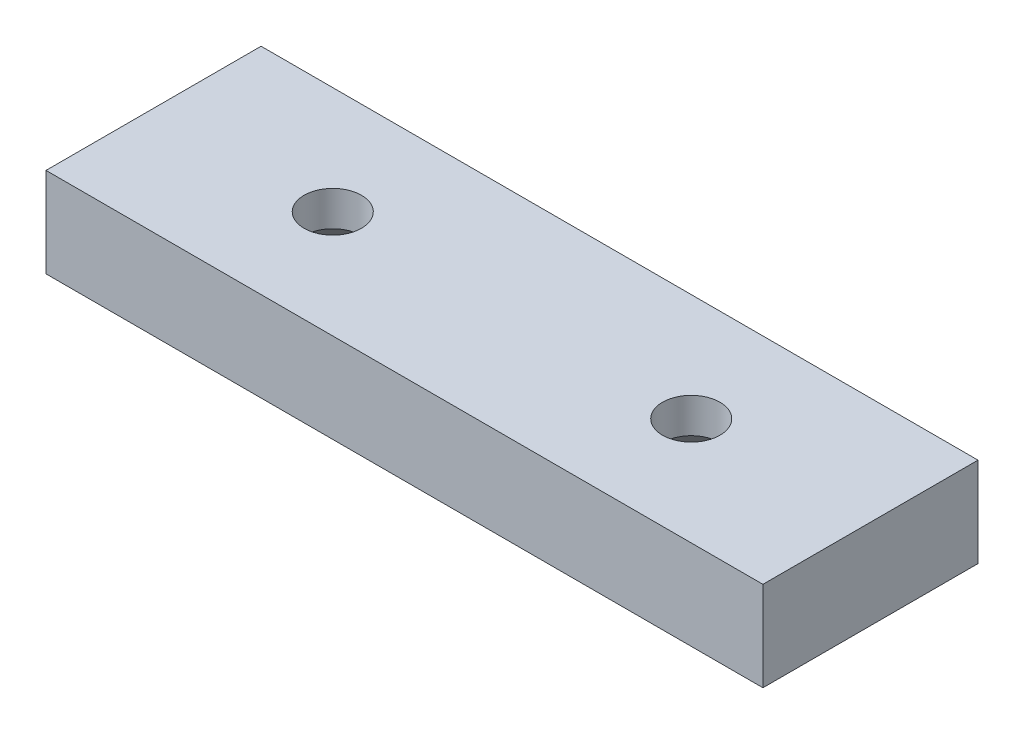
ISO-10303-21;
HEADER;
FILE_DESCRIPTION(('STEP AP214'),'2;1');
FILE_NAME('part.step','',(''),(''),'','','');
FILE_SCHEMA(('AUTOMOTIVE_DESIGN { 1 0 10303 214 1 1 1 1 }'));
ENDSEC;
DATA;
#1=APPLICATION_CONTEXT('core data for automotive mechanical design processes');
#2=APPLICATION_PROTOCOL_DEFINITION('international standard','automotive_design',2000,#1);
#3=PRODUCT_CONTEXT('',#1,'mechanical');
#4=PRODUCT('Part','Part','',(#3));
#5=PRODUCT_RELATED_PRODUCT_CATEGORY('part','',(#4));
#6=PRODUCT_DEFINITION_FORMATION('','',#4);
#7=PRODUCT_DEFINITION_CONTEXT('part definition',#1,'design');
#8=PRODUCT_DEFINITION('design','',#6,#7);
#9=PRODUCT_DEFINITION_SHAPE('','',#8);
#10=(LENGTH_UNIT() NAMED_UNIT(*) SI_UNIT(.MILLI.,.METRE.));
#11=(NAMED_UNIT(*) PLANE_ANGLE_UNIT() SI_UNIT($,.RADIAN.));
#12=(NAMED_UNIT(*) SI_UNIT($,.STERADIAN.) SOLID_ANGLE_UNIT());
#13=UNCERTAINTY_MEASURE_WITH_UNIT(LENGTH_MEASURE(1.E-05),#10,'distance_accuracy_value','');
#14=(GEOMETRIC_REPRESENTATION_CONTEXT(3) GLOBAL_UNCERTAINTY_ASSIGNED_CONTEXT((#13)) GLOBAL_UNIT_ASSIGNED_CONTEXT((#10,
#11,#12)) REPRESENTATION_CONTEXT('',''));
#15=CARTESIAN_POINT('',(0.,0.,0.));
#16=DIRECTION('',(0.,0.,1.));
#17=DIRECTION('',(1.,0.,0.));
#18=AXIS2_PLACEMENT_3D('',#15,#16,#17);
#19=CARTESIAN_POINT('',(0.,10.,12.));
#20=DIRECTION('',(1.,0.,0.));
#21=DIRECTION('',(0.,0.,-1.));
#22=AXIS2_PLACEMENT_3D('',#19,#20,#21);
#23=PLANE('',#22);
#24=DIRECTION('',(0.,0.,1.));
#25=VECTOR('',#24,1.);
#26=CARTESIAN_POINT('',(0.,0.,12.));
#27=LINE('',#26,#25);
#28=CARTESIAN_POINT('',(0.,0.,-12.));
#29=VERTEX_POINT('',#28);
#30=CARTESIAN_POINT('',(0.,0.,12.));
#31=VERTEX_POINT('',#30);
#32=EDGE_CURVE('E80',#29,#31,#27,.T.);
#33=ORIENTED_EDGE('',*,*,#32,.T.);
#34=DIRECTION('',(0.,-1.,0.));
#35=VECTOR('',#34,1.);
#36=CARTESIAN_POINT('',(0.,10.,12.));
#37=LINE('',#36,#35);
#38=CARTESIAN_POINT('',(0.,10.,12.));
#39=VERTEX_POINT('',#38);
#40=EDGE_CURVE('E11',#39,#31,#37,.T.);
#41=ORIENTED_EDGE('',*,*,#40,.F.);
#42=DIRECTION('',(0.,0.,1.));
#43=VECTOR('',#42,1.);
#44=CARTESIAN_POINT('',(0.,10.,12.));
#45=LINE('',#44,#43);
#46=CARTESIAN_POINT('',(0.,9.99999999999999,-12.));
#47=VERTEX_POINT('',#46);
#48=EDGE_CURVE('E103',#47,#39,#45,.T.);
#49=ORIENTED_EDGE('',*,*,#48,.F.);
#50=DIRECTION('',(0.,-1.,0.));
#51=VECTOR('',#50,1.);
#52=CARTESIAN_POINT('',(0.,9.99999999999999,-12.));
#53=LINE('',#52,#51);
#54=EDGE_CURVE('E92',#47,#29,#53,.T.);
#55=ORIENTED_EDGE('',*,*,#54,.T.);
#56=EDGE_LOOP('',(#33,#41,#49,#55));
#57=FACE_BOUND('',#56,.T.);
#58=ADVANCED_FACE('F36',(#57),#23,.F.);
#59=CARTESIAN_POINT('',(0.,10.,12.));
#60=DIRECTION('',(0.,0.,-1.));
#61=DIRECTION('',(-1.,0.,0.));
#62=AXIS2_PLACEMENT_3D('',#59,#60,#61);
#63=PLANE('',#62);
#64=DIRECTION('',(1.,0.,0.));
#65=VECTOR('',#64,1.);
#66=CARTESIAN_POINT('',(0.,0.,12.));
#67=LINE('',#66,#65);
#68=CARTESIAN_POINT('',(80.,0.,12.));
#69=VERTEX_POINT('',#68);
#70=EDGE_CURVE('E76',#31,#69,#67,.T.);
#71=ORIENTED_EDGE('',*,*,#70,.T.);
#72=DIRECTION('',(0.,-1.,0.));
#73=VECTOR('',#72,1.);
#74=CARTESIAN_POINT('',(80.,9.99999999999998,12.));
#75=LINE('',#74,#73);
#76=CARTESIAN_POINT('',(80.,9.99999999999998,12.));
#77=VERTEX_POINT('',#76);
#78=EDGE_CURVE('E43',#77,#69,#75,.T.);
#79=ORIENTED_EDGE('',*,*,#78,.F.);
#80=DIRECTION('',(1.,0.,0.));
#81=VECTOR('',#80,1.);
#82=CARTESIAN_POINT('',(0.,10.,12.));
#83=LINE('',#82,#81);
#84=EDGE_CURVE('E88',#39,#77,#83,.T.);
#85=ORIENTED_EDGE('',*,*,#84,.F.);
#86=ORIENTED_EDGE('',*,*,#40,.T.);
#87=EDGE_LOOP('',(#71,#79,#85,#86));
#88=FACE_BOUND('',#87,.T.);
#89=ADVANCED_FACE('F87',(#88),#63,.F.);
#90=CARTESIAN_POINT('',(80.,9.99999999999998,12.));
#91=DIRECTION('',(-1.,0.,0.));
#92=DIRECTION('',(0.,0.,1.));
#93=AXIS2_PLACEMENT_3D('',#90,#91,#92);
#94=PLANE('',#93);
#95=DIRECTION('',(0.,0.,-1.));
#96=VECTOR('',#95,1.);
#97=CARTESIAN_POINT('',(80.,0.,12.));
#98=LINE('',#97,#96);
#99=CARTESIAN_POINT('',(80.,0.,-12.));
#100=VERTEX_POINT('',#99);
#101=EDGE_CURVE('E81',#69,#100,#98,.T.);
#102=ORIENTED_EDGE('',*,*,#101,.T.);
#103=DIRECTION('',(0.,-1.,0.));
#104=VECTOR('',#103,1.);
#105=CARTESIAN_POINT('',(80.,9.99999999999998,-12.));
#106=LINE('',#105,#104);
#107=CARTESIAN_POINT('',(80.,9.99999999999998,-12.));
#108=VERTEX_POINT('',#107);
#109=EDGE_CURVE('E109',#108,#100,#106,.T.);
#110=ORIENTED_EDGE('',*,*,#109,.F.);
#111=DIRECTION('',(0.,0.,-1.));
#112=VECTOR('',#111,1.);
#113=CARTESIAN_POINT('',(80.,9.99999999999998,12.));
#114=LINE('',#113,#112);
#115=EDGE_CURVE('E55',#77,#108,#114,.T.);
#116=ORIENTED_EDGE('',*,*,#115,.F.);
#117=ORIENTED_EDGE('',*,*,#78,.T.);
#118=EDGE_LOOP('',(#102,#110,#116,#117));
#119=FACE_BOUND('',#118,.T.);
#120=ADVANCED_FACE('F112',(#119),#94,.F.);
#121=CARTESIAN_POINT('',(0.,9.99999999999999,-12.));
#122=DIRECTION('',(0.,0.,1.));
#123=DIRECTION('',(1.,0.,0.));
#124=AXIS2_PLACEMENT_3D('',#121,#122,#123);
#125=PLANE('',#124);
#126=DIRECTION('',(-1.,0.,0.));
#127=VECTOR('',#126,1.);
#128=CARTESIAN_POINT('',(0.,0.,-12.));
#129=LINE('',#128,#127);
#130=EDGE_CURVE('E101',#100,#29,#129,.T.);
#131=ORIENTED_EDGE('',*,*,#130,.T.);
#132=ORIENTED_EDGE('',*,*,#54,.F.);
#133=DIRECTION('',(-1.,0.,0.));
#134=VECTOR('',#133,1.);
#135=CARTESIAN_POINT('',(0.,9.99999999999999,-12.));
#136=LINE('',#135,#134);
#137=EDGE_CURVE('E50',#108,#47,#136,.T.);
#138=ORIENTED_EDGE('',*,*,#137,.F.);
#139=ORIENTED_EDGE('',*,*,#109,.T.);
#140=EDGE_LOOP('',(#131,#132,#138,#139));
#141=FACE_BOUND('',#140,.T.);
#142=ADVANCED_FACE('F114',(#141),#125,.F.);
#143=CARTESIAN_POINT('',(0.,9.99999999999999,-12.));
#144=DIRECTION('',(0.,-1.,0.));
#145=DIRECTION('',(0.,0.,-1.));
#146=AXIS2_PLACEMENT_3D('',#143,#144,#145);
#147=PLANE('',#146);
#148=CARTESIAN_POINT('',(20.,9.99999999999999,0.));
#149=DIRECTION('',(0.,-1.,0.));
#150=DIRECTION('',(0.,0.,-1.));
#151=AXIS2_PLACEMENT_3D('',#148,#149,#150);
#152=CIRCLE('',#151,3.19999999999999);
#153=CARTESIAN_POINT('',(20.,10.,-3.19999999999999));
#154=VERTEX_POINT('',#153);
#155=EDGE_CURVE('E230',#154,#154,#152,.T.);
#156=ORIENTED_EDGE('',*,*,#155,.T.);
#157=EDGE_LOOP('',(#156));
#158=FACE_BOUND('',#157,.T.);
#159=CARTESIAN_POINT('',(60.,9.99999999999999,0.));
#160=DIRECTION('',(0.,-1.,0.));
#161=DIRECTION('',(0.,0.,-1.));
#162=AXIS2_PLACEMENT_3D('',#159,#160,#161);
#163=CIRCLE('',#162,3.19999999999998);
#164=CARTESIAN_POINT('',(60.,9.99999999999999,-3.19999999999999));
#165=VERTEX_POINT('',#164);
#166=EDGE_CURVE('E93',#165,#165,#163,.T.);
#167=ORIENTED_EDGE('',*,*,#166,.T.);
#168=EDGE_LOOP('',(#167));
#169=FACE_BOUND('',#168,.T.);
#170=ORIENTED_EDGE('',*,*,#48,.T.);
#171=ORIENTED_EDGE('',*,*,#84,.T.);
#172=ORIENTED_EDGE('',*,*,#115,.T.);
#173=ORIENTED_EDGE('',*,*,#137,.T.);
#174=EDGE_LOOP('',(#170,#171,#172,#173));
#175=FACE_BOUND('',#174,.T.);
#176=ADVANCED_FACE('F115',(#158,#169,#175),#147,.F.);
#177=CARTESIAN_POINT('',(0.,0.,-12.));
#178=DIRECTION('',(0.,-1.,0.));
#179=DIRECTION('',(0.,0.,-1.));
#180=AXIS2_PLACEMENT_3D('',#177,#178,#179);
#181=PLANE('',#180);
#182=CARTESIAN_POINT('',(20.,0.,0.));
#183=DIRECTION('',(0.,-1.,0.));
#184=DIRECTION('',(0.,0.,-1.));
#185=AXIS2_PLACEMENT_3D('',#182,#183,#184);
#186=CIRCLE('',#185,6.3);
#187=CARTESIAN_POINT('',(20.,0.,-6.3));
#188=VERTEX_POINT('',#187);
#189=EDGE_CURVE('E223',#188,#188,#186,.T.);
#190=ORIENTED_EDGE('',*,*,#189,.F.);
#191=EDGE_LOOP('',(#190));
#192=FACE_BOUND('',#191,.T.);
#193=CARTESIAN_POINT('',(60.,0.,0.));
#194=DIRECTION('',(0.,-1.,0.));
#195=DIRECTION('',(0.,0.,-1.));
#196=AXIS2_PLACEMENT_3D('',#193,#194,#195);
#197=CIRCLE('',#196,6.3);
#198=CARTESIAN_POINT('',(60.,0.,-6.3));
#199=VERTEX_POINT('',#198);
#200=EDGE_CURVE('E232',#199,#199,#197,.T.);
#201=ORIENTED_EDGE('',*,*,#200,.F.);
#202=EDGE_LOOP('',(#201));
#203=FACE_BOUND('',#202,.T.);
#204=ORIENTED_EDGE('',*,*,#32,.F.);
#205=ORIENTED_EDGE('',*,*,#130,.F.);
#206=ORIENTED_EDGE('',*,*,#101,.F.);
#207=ORIENTED_EDGE('',*,*,#70,.F.);
#208=EDGE_LOOP('',(#204,#205,#206,#207));
#209=FACE_BOUND('',#208,.T.);
#210=ADVANCED_FACE('F77',(#192,#203,#209),#181,.T.);
#211=CARTESIAN_POINT('',(60.,0.,0.));
#212=DIRECTION('',(0.,-1.,0.));
#213=DIRECTION('',(0.,0.,-1.));
#214=AXIS2_PLACEMENT_3D('',#211,#212,#213);
#215=CYLINDRICAL_SURFACE('',#214,3.19999999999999);
#216=CARTESIAN_POINT('',(60.,6.09999999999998,0.));
#217=DIRECTION('',(0.,-1.,0.));
#218=DIRECTION('',(0.,0.,-1.));
#219=AXIS2_PLACEMENT_3D('',#216,#217,#218);
#220=CIRCLE('',#219,3.19999999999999);
#221=CARTESIAN_POINT('',(60.,6.09999999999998,-3.19999999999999));
#222=VERTEX_POINT('',#221);
#223=EDGE_CURVE('E96',#222,#222,#220,.T.);
#224=CARTESIAN_POINT('',(60.,9.99999999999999,-3.19999999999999));
#225=CARTESIAN_POINT('',(60.,9.95937499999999,-3.19999999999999));
#226=CARTESIAN_POINT('',(60.,9.91874999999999,-3.19999999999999));
#227=CARTESIAN_POINT('',(60.,9.83749999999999,-3.19999999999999));
#228=CARTESIAN_POINT('',(60.,9.79687499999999,-3.19999999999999));
#229=CARTESIAN_POINT('',(60.,9.71562499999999,-3.19999999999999));
#230=CARTESIAN_POINT('',(60.,9.67499999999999,-3.19999999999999));
#231=CARTESIAN_POINT('',(60.,9.59374999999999,-3.19999999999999));
#232=CARTESIAN_POINT('',(60.,9.55312499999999,-3.19999999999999));
#233=CARTESIAN_POINT('',(60.,9.47187499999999,-3.19999999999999));
#234=CARTESIAN_POINT('',(60.,9.43124999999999,-3.19999999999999));
#235=CARTESIAN_POINT('',(60.,9.34999999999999,-3.19999999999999));
#236=CARTESIAN_POINT('',(60.,9.30937499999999,-3.19999999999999));
#237=CARTESIAN_POINT('',(60.,9.22812499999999,-3.19999999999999));
#238=CARTESIAN_POINT('',(60.,9.18749999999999,-3.19999999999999));
#239=CARTESIAN_POINT('',(60.,9.10624999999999,-3.19999999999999));
#240=CARTESIAN_POINT('',(60.,9.06562499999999,-3.19999999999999));
#241=CARTESIAN_POINT('',(60.,8.98437499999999,-3.19999999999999));
#242=CARTESIAN_POINT('',(60.,8.94374999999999,-3.19999999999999));
#243=CARTESIAN_POINT('',(60.,8.86249999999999,-3.19999999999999));
#244=CARTESIAN_POINT('',(60.,8.82187499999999,-3.19999999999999));
#245=CARTESIAN_POINT('',(60.,8.74062499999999,-3.19999999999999));
#246=CARTESIAN_POINT('',(60.,8.69999999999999,-3.19999999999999));
#247=CARTESIAN_POINT('',(60.,8.61874999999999,-3.19999999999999));
#248=CARTESIAN_POINT('',(60.,8.57812499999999,-3.19999999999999));
#249=CARTESIAN_POINT('',(60.,8.49687499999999,-3.19999999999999));
#250=CARTESIAN_POINT('',(60.,8.45624999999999,-3.19999999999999));
#251=CARTESIAN_POINT('',(60.,8.37499999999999,-3.19999999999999));
#252=CARTESIAN_POINT('',(60.,8.33437499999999,-3.19999999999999));
#253=CARTESIAN_POINT('',(60.,8.25312499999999,-3.19999999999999));
#254=CARTESIAN_POINT('',(60.,8.21249999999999,-3.19999999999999));
#255=CARTESIAN_POINT('',(60.,8.13124999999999,-3.19999999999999));
#256=CARTESIAN_POINT('',(60.,8.09062499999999,-3.19999999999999));
#257=CARTESIAN_POINT('',(60.,8.00937499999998,-3.19999999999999));
#258=CARTESIAN_POINT('',(60.,7.96874999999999,-3.19999999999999));
#259=CARTESIAN_POINT('',(60.,7.88749999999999,-3.19999999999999));
#260=CARTESIAN_POINT('',(60.,7.84687499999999,-3.19999999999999));
#261=CARTESIAN_POINT('',(60.,7.76562499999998,-3.19999999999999));
#262=CARTESIAN_POINT('',(60.,7.72499999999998,-3.19999999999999));
#263=CARTESIAN_POINT('',(60.,7.64374999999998,-3.19999999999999));
#264=CARTESIAN_POINT('',(60.,7.60312499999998,-3.19999999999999));
#265=CARTESIAN_POINT('',(60.,7.52187499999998,-3.19999999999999));
#266=CARTESIAN_POINT('',(60.,7.48124999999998,-3.19999999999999));
#267=CARTESIAN_POINT('',(60.,7.39999999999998,-3.19999999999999));
#268=CARTESIAN_POINT('',(60.,7.35937499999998,-3.19999999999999));
#269=CARTESIAN_POINT('',(60.,7.27812499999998,-3.19999999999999));
#270=CARTESIAN_POINT('',(60.,7.23749999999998,-3.19999999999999));
#271=CARTESIAN_POINT('',(60.,7.15624999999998,-3.19999999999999));
#272=CARTESIAN_POINT('',(60.,7.11562499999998,-3.19999999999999));
#273=CARTESIAN_POINT('',(60.,7.03437499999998,-3.19999999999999));
#274=CARTESIAN_POINT('',(60.,6.99374999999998,-3.19999999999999));
#275=CARTESIAN_POINT('',(60.,6.91249999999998,-3.19999999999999));
#276=CARTESIAN_POINT('',(60.,6.87187499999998,-3.19999999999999));
#277=CARTESIAN_POINT('',(60.,6.79062499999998,-3.19999999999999));
#278=CARTESIAN_POINT('',(60.,6.74999999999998,-3.19999999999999));
#279=CARTESIAN_POINT('',(60.,6.66874999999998,-3.19999999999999));
#280=CARTESIAN_POINT('',(60.,6.62812499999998,-3.19999999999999));
#281=CARTESIAN_POINT('',(60.,6.54687499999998,-3.19999999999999));
#282=CARTESIAN_POINT('',(60.,6.50624999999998,-3.19999999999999));
#283=CARTESIAN_POINT('',(60.,6.42499999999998,-3.19999999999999));
#284=CARTESIAN_POINT('',(60.,6.38437499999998,-3.19999999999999));
#285=CARTESIAN_POINT('',(60.,6.30312499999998,-3.19999999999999));
#286=CARTESIAN_POINT('',(60.,6.26249999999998,-3.19999999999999));
#287=CARTESIAN_POINT('',(60.,6.18124999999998,-3.19999999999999));
#288=CARTESIAN_POINT('',(60.,6.14062499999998,-3.19999999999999));
#289=CARTESIAN_POINT('',(60.,6.09999999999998,-3.19999999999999));
#290=B_SPLINE_CURVE_WITH_KNOTS('',3,(#224,#225,#226,#227,#228,#229,#230,#231,#232,#233,#234,
#235,#236,#237,#238,#239,#240,#241,#242,#243,#244,#245,#246,#247,#248,#249,#250,#251,#252,#253,
#254,#255,#256,#257,#258,#259,#260,#261,#262,#263,#264,#265,#266,#267,#268,#269,#270,#271,#272,
#273,#274,#275,#276,#277,#278,#279,#280,#281,#282,#283,#284,#285,#286,#287,#288,#289),
.UNSPECIFIED.,.F.,.F.,(4,2,2,2,2,2,2,2,2,2,2,2,2,2,2,2,2,2,2,2,2,2,2,2,2,2,2,2,2,2,2,2,4),(0.,
0.121875,0.243749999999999,0.365625,0.4875,0.609375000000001,0.731250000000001,
0.853125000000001,0.975000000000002,1.096875,1.21875,1.340625,1.4625,1.584375,1.70625,1.828125,
1.95,2.071875,2.19375,2.31562500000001,2.43750000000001,2.55937500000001,2.68125000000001,
2.80312500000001,2.92500000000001,3.04687500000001,3.16875000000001,3.29062500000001,
3.41250000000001,3.53437500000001,3.65625000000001,3.77812500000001,3.90000000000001),.UNSPECIFIED.);
#291=EDGE_CURVE('BSEAM123',#165,#222,#290,.T.);
#292=ORIENTED_EDGE('',*,*,#166,.F.);
#293=ORIENTED_EDGE('',*,*,#223,.T.);
#294=ORIENTED_EDGE('',*,*,#291,.T.);
#295=ORIENTED_EDGE('',*,*,#291,.F.);
#296=EDGE_LOOP('',(#292,#294,#293,#295));
#297=FACE_BOUND('',#296,.T.);
#298=ADVANCED_FACE('F123',(#297),#215,.F.);
#299=CARTESIAN_POINT('',(60.,2.99999999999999,0.));
#300=DIRECTION('',(0.,-1.,0.));
#301=DIRECTION('',(0.,0.,-1.));
#302=AXIS2_PLACEMENT_3D('',#299,#300,#301);
#303=CONICAL_SURFACE('',#302,6.3,0.78539816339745);
#304=CARTESIAN_POINT('',(60.,2.99999999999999,0.));
#305=DIRECTION('',(0.,-1.,0.));
#306=DIRECTION('',(0.,0.,-1.));
#307=AXIS2_PLACEMENT_3D('',#304,#305,#306);
#308=CIRCLE('',#307,6.3);
#309=CARTESIAN_POINT('',(60.,2.99999999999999,-6.3));
#310=VERTEX_POINT('',#309);
#311=EDGE_CURVE('E235',#310,#310,#308,.T.);
#312=CARTESIAN_POINT('',(60.,6.09999999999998,-3.19999999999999));
#313=CARTESIAN_POINT('',(60.,6.06770833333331,-3.23229166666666));
#314=CARTESIAN_POINT('',(60.,6.03541666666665,-3.26458333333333));
#315=CARTESIAN_POINT('',(60.,5.97083333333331,-3.32916666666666));
#316=CARTESIAN_POINT('',(60.,5.93854166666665,-3.36145833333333));
#317=CARTESIAN_POINT('',(60.,5.87395833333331,-3.42604166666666));
#318=CARTESIAN_POINT('',(60.,5.84166666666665,-3.45833333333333));
#319=CARTESIAN_POINT('',(60.,5.77708333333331,-3.52291666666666));
#320=CARTESIAN_POINT('',(60.,5.74479166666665,-3.55520833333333));
#321=CARTESIAN_POINT('',(60.,5.68020833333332,-3.61979166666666));
#322=CARTESIAN_POINT('',(60.,5.64791666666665,-3.65208333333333));
#323=CARTESIAN_POINT('',(60.,5.58333333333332,-3.71666666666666));
#324=CARTESIAN_POINT('',(60.,5.55104166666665,-3.74895833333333));
#325=CARTESIAN_POINT('',(60.,5.48645833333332,-3.81354166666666));
#326=CARTESIAN_POINT('',(60.,5.45416666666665,-3.84583333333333));
#327=CARTESIAN_POINT('',(60.,5.38958333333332,-3.91041666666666));
#328=CARTESIAN_POINT('',(60.,5.35729166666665,-3.94270833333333));
#329=CARTESIAN_POINT('',(60.,5.29270833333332,-4.00729166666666));
#330=CARTESIAN_POINT('',(60.,5.26041666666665,-4.03958333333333));
#331=CARTESIAN_POINT('',(60.,5.19583333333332,-4.10416666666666));
#332=CARTESIAN_POINT('',(60.,5.16354166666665,-4.13645833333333));
#333=CARTESIAN_POINT('',(60.,5.09895833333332,-4.20104166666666));
#334=CARTESIAN_POINT('',(60.,5.06666666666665,-4.23333333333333));
#335=CARTESIAN_POINT('',(60.,5.00208333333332,-4.29791666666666));
#336=CARTESIAN_POINT('',(60.,4.96979166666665,-4.33020833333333));
#337=CARTESIAN_POINT('',(60.,4.90520833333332,-4.39479166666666));
#338=CARTESIAN_POINT('',(60.,4.87291666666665,-4.42708333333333));
#339=CARTESIAN_POINT('',(60.,4.80833333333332,-4.49166666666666));
#340=CARTESIAN_POINT('',(60.,4.77604166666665,-4.52395833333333));
#341=CARTESIAN_POINT('',(60.,4.71145833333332,-4.58854166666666));
#342=CARTESIAN_POINT('',(60.,4.67916666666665,-4.62083333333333));
#343=CARTESIAN_POINT('',(60.,4.61458333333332,-4.68541666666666));
#344=CARTESIAN_POINT('',(60.,4.58229166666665,-4.71770833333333));
#345=CARTESIAN_POINT('',(60.,4.51770833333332,-4.78229166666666));
#346=CARTESIAN_POINT('',(60.,4.48541666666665,-4.81458333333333));
#347=CARTESIAN_POINT('',(60.,4.42083333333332,-4.87916666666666));
#348=CARTESIAN_POINT('',(60.,4.38854166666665,-4.91145833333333));
#349=CARTESIAN_POINT('',(60.,4.32395833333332,-4.97604166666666));
#350=CARTESIAN_POINT('',(60.,4.29166666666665,-5.00833333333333));
#351=CARTESIAN_POINT('',(60.,4.22708333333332,-5.07291666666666));
#352=CARTESIAN_POINT('',(60.,4.19479166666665,-5.10520833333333));
#353=CARTESIAN_POINT('',(60.,4.13020833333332,-5.16979166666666));
#354=CARTESIAN_POINT('',(60.,4.09791666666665,-5.20208333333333));
#355=CARTESIAN_POINT('',(60.,4.03333333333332,-5.26666666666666));
#356=CARTESIAN_POINT('',(60.,4.00104166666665,-5.29895833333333));
#357=CARTESIAN_POINT('',(60.,3.93645833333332,-5.36354166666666));
#358=CARTESIAN_POINT('',(60.,3.90416666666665,-5.39583333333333));
#359=CARTESIAN_POINT('',(60.,3.83958333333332,-5.46041666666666));
#360=CARTESIAN_POINT('',(60.,3.80729166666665,-5.49270833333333));
#361=CARTESIAN_POINT('',(60.,3.74270833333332,-5.55729166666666));
#362=CARTESIAN_POINT('',(60.,3.71041666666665,-5.58958333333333));
#363=CARTESIAN_POINT('',(60.,3.64583333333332,-5.65416666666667));
#364=CARTESIAN_POINT('',(60.,3.61354166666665,-5.68645833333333));
#365=CARTESIAN_POINT('',(60.,3.54895833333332,-5.75104166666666));
#366=CARTESIAN_POINT('',(60.,3.51666666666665,-5.78333333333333));
#367=CARTESIAN_POINT('',(60.,3.45208333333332,-5.84791666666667));
#368=CARTESIAN_POINT('',(60.,3.41979166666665,-5.88020833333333));
#369=CARTESIAN_POINT('',(60.,3.35520833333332,-5.94479166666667));
#370=CARTESIAN_POINT('',(60.,3.32291666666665,-5.97708333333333));
#371=CARTESIAN_POINT('',(60.,3.25833333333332,-6.04166666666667));
#372=CARTESIAN_POINT('',(60.,3.22604166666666,-6.07395833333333));
#373=CARTESIAN_POINT('',(60.,3.16145833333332,-6.13854166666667));
#374=CARTESIAN_POINT('',(60.,3.12916666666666,-6.17083333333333));
#375=CARTESIAN_POINT('',(60.,3.06458333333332,-6.23541666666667));
#376=CARTESIAN_POINT('',(60.,3.03229166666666,-6.26770833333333));
#377=CARTESIAN_POINT('',(60.,2.99999999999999,-6.3));
#378=B_SPLINE_CURVE_WITH_KNOTS('',3,(#312,#313,#314,#315,#316,#317,#318,#319,#320,#321,#322,
#323,#324,#325,#326,#327,#328,#329,#330,#331,#332,#333,#334,#335,#336,#337,#338,#339,#340,#341,
#342,#343,#344,#345,#346,#347,#348,#349,#350,#351,#352,#353,#354,#355,#356,#357,#358,#359,#360,
#361,#362,#363,#364,#365,#366,#367,#368,#369,#370,#371,#372,#373,#374,#375,#376,#377),
.UNSPECIFIED.,.F.,.F.,(4,2,2,2,2,2,2,2,2,2,2,2,2,2,2,2,2,2,2,2,2,2,2,2,2,2,2,2,2,2,2,2,4),(0.,
0.137001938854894,0.274003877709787,0.411005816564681,0.548007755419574,0.685009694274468,
0.822011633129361,0.959013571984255,1.09601551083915,1.23301744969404,1.37001938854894,
1.50702132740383,1.64402326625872,1.78102520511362,1.91802714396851,2.0550290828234,
2.1920310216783,2.32903296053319,2.46603489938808,2.60303683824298,2.74003877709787,
2.87704071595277,3.01404265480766,3.15104459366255,3.28804653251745,3.42504847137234,
3.56205041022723,3.69905234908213,3.83605428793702,3.97305622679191,4.11005816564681,
4.2470601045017,4.38406204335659),.UNSPECIFIED.);
#379=EDGE_CURVE('BSEAM163',#222,#310,#378,.T.);
#380=ORIENTED_EDGE('',*,*,#223,.F.);
#381=ORIENTED_EDGE('',*,*,#311,.T.);
#382=ORIENTED_EDGE('',*,*,#379,.T.);
#383=ORIENTED_EDGE('',*,*,#379,.F.);
#384=EDGE_LOOP('',(#380,#382,#381,#383));
#385=FACE_BOUND('',#384,.T.);
#386=ADVANCED_FACE('F163',(#385),#303,.F.);
#387=CARTESIAN_POINT('',(60.,0.,0.));
#388=DIRECTION('',(0.,-1.,0.));
#389=DIRECTION('',(0.,0.,-1.));
#390=AXIS2_PLACEMENT_3D('',#387,#388,#389);
#391=CYLINDRICAL_SURFACE('',#390,6.3);
#392=CARTESIAN_POINT('',(60.,2.99999999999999,-6.3));
#393=CARTESIAN_POINT('',(60.,2.96874999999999,-6.3));
#394=CARTESIAN_POINT('',(60.,2.93749999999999,-6.3));
#395=CARTESIAN_POINT('',(60.,2.87499999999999,-6.3));
#396=CARTESIAN_POINT('',(60.,2.84374999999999,-6.3));
#397=CARTESIAN_POINT('',(60.,2.78124999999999,-6.3));
#398=CARTESIAN_POINT('',(60.,2.74999999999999,-6.3));
#399=CARTESIAN_POINT('',(60.,2.68749999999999,-6.3));
#400=CARTESIAN_POINT('',(60.,2.65624999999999,-6.3));
#401=CARTESIAN_POINT('',(60.,2.59374999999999,-6.3));
#402=CARTESIAN_POINT('',(60.,2.56249999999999,-6.3));
#403=CARTESIAN_POINT('',(60.,2.49999999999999,-6.3));
#404=CARTESIAN_POINT('',(60.,2.46874999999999,-6.3));
#405=CARTESIAN_POINT('',(60.,2.40624999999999,-6.3));
#406=CARTESIAN_POINT('',(60.,2.37499999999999,-6.3));
#407=CARTESIAN_POINT('',(60.,2.31249999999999,-6.3));
#408=CARTESIAN_POINT('',(60.,2.28124999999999,-6.3));
#409=CARTESIAN_POINT('',(60.,2.21874999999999,-6.3));
#410=CARTESIAN_POINT('',(60.,2.18749999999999,-6.3));
#411=CARTESIAN_POINT('',(60.,2.12499999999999,-6.3));
#412=CARTESIAN_POINT('',(60.,2.09374999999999,-6.3));
#413=CARTESIAN_POINT('',(60.,2.03124999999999,-6.3));
#414=CARTESIAN_POINT('',(60.,1.99999999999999,-6.3));
#415=CARTESIAN_POINT('',(60.,1.93749999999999,-6.3));
#416=CARTESIAN_POINT('',(60.,1.90624999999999,-6.3));
#417=CARTESIAN_POINT('',(60.,1.84374999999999,-6.3));
#418=CARTESIAN_POINT('',(60.,1.81249999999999,-6.3));
#419=CARTESIAN_POINT('',(60.,1.74999999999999,-6.3));
#420=CARTESIAN_POINT('',(60.,1.71874999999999,-6.3));
#421=CARTESIAN_POINT('',(60.,1.65624999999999,-6.3));
#422=CARTESIAN_POINT('',(60.,1.62499999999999,-6.3));
#423=CARTESIAN_POINT('',(60.,1.56249999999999,-6.3));
#424=CARTESIAN_POINT('',(60.,1.53124999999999,-6.3));
#425=CARTESIAN_POINT('',(60.,1.46874999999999,-6.3));
#426=CARTESIAN_POINT('',(60.,1.43749999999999,-6.3));
#427=CARTESIAN_POINT('',(60.,1.37499999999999,-6.3));
#428=CARTESIAN_POINT('',(60.,1.34374999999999,-6.3));
#429=CARTESIAN_POINT('',(60.,1.28124999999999,-6.3));
#430=CARTESIAN_POINT('',(60.,1.24999999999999,-6.3));
#431=CARTESIAN_POINT('',(60.,1.18749999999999,-6.3));
#432=CARTESIAN_POINT('',(60.,1.15624999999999,-6.3));
#433=CARTESIAN_POINT('',(60.,1.09374999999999,-6.3));
#434=CARTESIAN_POINT('',(60.,1.06249999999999,-6.3));
#435=CARTESIAN_POINT('',(60.,0.99999999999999,-6.3));
#436=CARTESIAN_POINT('',(60.,0.96874999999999,-6.3));
#437=CARTESIAN_POINT('',(60.,0.90624999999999,-6.3));
#438=CARTESIAN_POINT('',(60.,0.87499999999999,-6.3));
#439=CARTESIAN_POINT('',(60.,0.81249999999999,-6.3));
#440=CARTESIAN_POINT('',(60.,0.78124999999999,-6.3));
#441=CARTESIAN_POINT('',(60.,0.718749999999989,-6.3));
#442=CARTESIAN_POINT('',(60.,0.687499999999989,-6.3));
#443=CARTESIAN_POINT('',(60.,0.624999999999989,-6.3));
#444=CARTESIAN_POINT('',(60.,0.593749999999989,-6.3));
#445=CARTESIAN_POINT('',(60.,0.531249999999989,-6.3));
#446=CARTESIAN_POINT('',(60.,0.499999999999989,-6.3));
#447=CARTESIAN_POINT('',(60.,0.43749999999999,-6.3));
#448=CARTESIAN_POINT('',(60.,0.40624999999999,-6.3));
#449=CARTESIAN_POINT('',(60.,0.34374999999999,-6.3));
#450=CARTESIAN_POINT('',(60.,0.31249999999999,-6.3));
#451=CARTESIAN_POINT('',(60.,0.24999999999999,-6.3));
#452=CARTESIAN_POINT('',(60.,0.21874999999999,-6.3));
#453=CARTESIAN_POINT('',(60.,0.15624999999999,-6.3));
#454=CARTESIAN_POINT('',(60.,0.12499999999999,-6.3));
#455=CARTESIAN_POINT('',(60.,0.0624999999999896,-6.3));
#456=CARTESIAN_POINT('',(60.,0.0312499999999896,-6.3));
#457=CARTESIAN_POINT('',(60.,0.,-6.3));
#458=B_SPLINE_CURVE_WITH_KNOTS('',3,(#392,#393,#394,#395,#396,#397,#398,#399,#400,#401,#402,
#403,#404,#405,#406,#407,#408,#409,#410,#411,#412,#413,#414,#415,#416,#417,#418,#419,#420,#421,
#422,#423,#424,#425,#426,#427,#428,#429,#430,#431,#432,#433,#434,#435,#436,#437,#438,#439,#440,
#441,#442,#443,#444,#445,#446,#447,#448,#449,#450,#451,#452,#453,#454,#455,#456,#457),
.UNSPECIFIED.,.F.,.F.,(4,2,2,2,2,2,2,2,2,2,2,2,2,2,2,2,2,2,2,2,2,2,2,2,2,2,2,2,2,2,2,2,4),(0.,
0.0937500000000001,0.1875,0.28125,0.375,0.46875,0.5625,0.65625,0.75,0.84375,0.9375,1.03125,
1.125,1.21875,1.3125,1.40625,1.5,1.59375,1.6875,1.78125,1.875,1.96875,2.0625,2.15625,2.25,
2.34375,2.4375,2.53125,2.625,2.71875,2.8125,2.90625,3.),.UNSPECIFIED.);
#459=EDGE_CURVE('BSEAM173',#310,#199,#458,.T.);
#460=ORIENTED_EDGE('',*,*,#311,.F.);
#461=ORIENTED_EDGE('',*,*,#200,.T.);
#462=ORIENTED_EDGE('',*,*,#459,.T.);
#463=ORIENTED_EDGE('',*,*,#459,.F.);
#464=EDGE_LOOP('',(#460,#462,#461,#463));
#465=FACE_BOUND('',#464,.T.);
#466=ADVANCED_FACE('F173',(#465),#391,.F.);
#467=CARTESIAN_POINT('',(20.,0.,0.));
#468=DIRECTION('',(0.,-1.,0.));
#469=DIRECTION('',(0.,0.,-1.));
#470=AXIS2_PLACEMENT_3D('',#467,#468,#469);
#471=CYLINDRICAL_SURFACE('',#470,3.19999999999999);
#472=CARTESIAN_POINT('',(20.,6.09999999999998,0.));
#473=DIRECTION('',(0.,-1.,0.));
#474=DIRECTION('',(0.,0.,-1.));
#475=AXIS2_PLACEMENT_3D('',#472,#473,#474);
#476=CIRCLE('',#475,3.2);
#477=CARTESIAN_POINT('',(20.,6.09999999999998,-3.19999999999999));
#478=VERTEX_POINT('',#477);
#479=EDGE_CURVE('E225',#478,#478,#476,.T.);
#480=CARTESIAN_POINT('',(20.,10.,-3.19999999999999));
#481=CARTESIAN_POINT('',(20.,9.959375,-3.19999999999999));
#482=CARTESIAN_POINT('',(20.,9.91875,-3.19999999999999));
#483=CARTESIAN_POINT('',(20.,9.8375,-3.19999999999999));
#484=CARTESIAN_POINT('',(20.,9.796875,-3.19999999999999));
#485=CARTESIAN_POINT('',(20.,9.715625,-3.19999999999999));
#486=CARTESIAN_POINT('',(20.,9.675,-3.19999999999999));
#487=CARTESIAN_POINT('',(20.,9.59375,-3.19999999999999));
#488=CARTESIAN_POINT('',(20.,9.553125,-3.19999999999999));
#489=CARTESIAN_POINT('',(20.,9.471875,-3.19999999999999));
#490=CARTESIAN_POINT('',(20.,9.43125,-3.19999999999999));
#491=CARTESIAN_POINT('',(20.,9.35,-3.19999999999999));
#492=CARTESIAN_POINT('',(20.,9.309375,-3.19999999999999));
#493=CARTESIAN_POINT('',(20.,9.228125,-3.19999999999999));
#494=CARTESIAN_POINT('',(20.,9.1875,-3.19999999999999));
#495=CARTESIAN_POINT('',(20.,9.10624999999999,-3.19999999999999));
#496=CARTESIAN_POINT('',(20.,9.065625,-3.19999999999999));
#497=CARTESIAN_POINT('',(20.,8.98437499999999,-3.19999999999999));
#498=CARTESIAN_POINT('',(20.,8.94374999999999,-3.19999999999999));
#499=CARTESIAN_POINT('',(20.,8.86249999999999,-3.19999999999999));
#500=CARTESIAN_POINT('',(20.,8.821875,-3.19999999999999));
#501=CARTESIAN_POINT('',(20.,8.74062499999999,-3.19999999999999));
#502=CARTESIAN_POINT('',(20.,8.69999999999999,-3.19999999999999));
#503=CARTESIAN_POINT('',(20.,8.61874999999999,-3.19999999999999));
#504=CARTESIAN_POINT('',(20.,8.57812499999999,-3.19999999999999));
#505=CARTESIAN_POINT('',(20.,8.49687499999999,-3.19999999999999));
#506=CARTESIAN_POINT('',(20.,8.45624999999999,-3.19999999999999));
#507=CARTESIAN_POINT('',(20.,8.37499999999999,-3.19999999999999));
#508=CARTESIAN_POINT('',(20.,8.33437499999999,-3.19999999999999));
#509=CARTESIAN_POINT('',(20.,8.25312499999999,-3.19999999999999));
#510=CARTESIAN_POINT('',(20.,8.21249999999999,-3.19999999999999));
#511=CARTESIAN_POINT('',(20.,8.13124999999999,-3.19999999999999));
#512=CARTESIAN_POINT('',(20.,8.09062499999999,-3.19999999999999));
#513=CARTESIAN_POINT('',(20.,8.00937499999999,-3.19999999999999));
#514=CARTESIAN_POINT('',(20.,7.96874999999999,-3.19999999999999));
#515=CARTESIAN_POINT('',(20.,7.88749999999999,-3.19999999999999));
#516=CARTESIAN_POINT('',(20.,7.84687499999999,-3.19999999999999));
#517=CARTESIAN_POINT('',(20.,7.76562499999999,-3.19999999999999));
#518=CARTESIAN_POINT('',(20.,7.72499999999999,-3.19999999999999));
#519=CARTESIAN_POINT('',(20.,7.64374999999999,-3.19999999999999));
#520=CARTESIAN_POINT('',(20.,7.60312499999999,-3.19999999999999));
#521=CARTESIAN_POINT('',(20.,7.52187499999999,-3.19999999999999));
#522=CARTESIAN_POINT('',(20.,7.48124999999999,-3.19999999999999));
#523=CARTESIAN_POINT('',(20.,7.39999999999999,-3.19999999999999));
#524=CARTESIAN_POINT('',(20.,7.35937499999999,-3.19999999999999));
#525=CARTESIAN_POINT('',(20.,7.27812499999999,-3.19999999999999));
#526=CARTESIAN_POINT('',(20.,7.23749999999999,-3.19999999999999));
#527=CARTESIAN_POINT('',(20.,7.15624999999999,-3.19999999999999));
#528=CARTESIAN_POINT('',(20.,7.11562499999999,-3.19999999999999));
#529=CARTESIAN_POINT('',(20.,7.03437499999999,-3.19999999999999));
#530=CARTESIAN_POINT('',(20.,6.99374999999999,-3.19999999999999));
#531=CARTESIAN_POINT('',(20.,6.91249999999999,-3.19999999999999));
#532=CARTESIAN_POINT('',(20.,6.87187499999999,-3.19999999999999));
#533=CARTESIAN_POINT('',(20.,6.79062499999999,-3.19999999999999));
#534=CARTESIAN_POINT('',(20.,6.74999999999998,-3.19999999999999));
#535=CARTESIAN_POINT('',(20.,6.66874999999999,-3.19999999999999));
#536=CARTESIAN_POINT('',(20.,6.62812499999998,-3.19999999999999));
#537=CARTESIAN_POINT('',(20.,6.54687499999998,-3.19999999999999));
#538=CARTESIAN_POINT('',(20.,6.50624999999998,-3.19999999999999));
#539=CARTESIAN_POINT('',(20.,6.42499999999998,-3.19999999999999));
#540=CARTESIAN_POINT('',(20.,6.38437499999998,-3.19999999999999));
#541=CARTESIAN_POINT('',(20.,6.30312499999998,-3.19999999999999));
#542=CARTESIAN_POINT('',(20.,6.26249999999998,-3.19999999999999));
#543=CARTESIAN_POINT('',(20.,6.18124999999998,-3.19999999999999));
#544=CARTESIAN_POINT('',(20.,6.14062499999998,-3.19999999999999));
#545=CARTESIAN_POINT('',(20.,6.09999999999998,-3.19999999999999));
#546=B_SPLINE_CURVE_WITH_KNOTS('',3,(#480,#481,#482,#483,#484,#485,#486,#487,#488,#489,#490,
#491,#492,#493,#494,#495,#496,#497,#498,#499,#500,#501,#502,#503,#504,#505,#506,#507,#508,#509,
#510,#511,#512,#513,#514,#515,#516,#517,#518,#519,#520,#521,#522,#523,#524,#525,#526,#527,#528,
#529,#530,#531,#532,#533,#534,#535,#536,#537,#538,#539,#540,#541,#542,#543,#544,#545),
.UNSPECIFIED.,.F.,.F.,(4,2,2,2,2,2,2,2,2,2,2,2,2,2,2,2,2,2,2,2,2,2,2,2,2,2,2,2,2,2,2,2,4),(0.,
0.121875,0.243749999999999,0.365625,0.4875,0.609375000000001,0.731250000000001,
0.853125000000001,0.975000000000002,1.096875,1.21875,1.340625,1.4625,1.584375,1.70625,
1.82812500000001,1.95000000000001,2.07187500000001,2.19375000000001,2.31562500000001,
2.43750000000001,2.55937500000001,2.68125000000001,2.80312500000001,2.92500000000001,
3.04687500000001,3.16875000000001,3.29062500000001,3.41250000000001,3.53437500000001,
3.65625000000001,3.77812500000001,3.90000000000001),.UNSPECIFIED.);
#547=EDGE_CURVE('BSEAM183',#154,#478,#546,.T.);
#548=ORIENTED_EDGE('',*,*,#155,.F.);
#549=ORIENTED_EDGE('',*,*,#479,.T.);
#550=ORIENTED_EDGE('',*,*,#547,.T.);
#551=ORIENTED_EDGE('',*,*,#547,.F.);
#552=EDGE_LOOP('',(#548,#550,#549,#551));
#553=FACE_BOUND('',#552,.T.);
#554=ADVANCED_FACE('F183',(#553),#471,.F.);
#555=CARTESIAN_POINT('',(20.,3.,0.));
#556=DIRECTION('',(0.,-1.,0.));
#557=DIRECTION('',(0.,0.,-1.));
#558=AXIS2_PLACEMENT_3D('',#555,#556,#557);
#559=CONICAL_SURFACE('',#558,6.3,0.78539816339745);
#560=CARTESIAN_POINT('',(20.,3.,0.));
#561=DIRECTION('',(0.,-1.,0.));
#562=DIRECTION('',(0.,0.,-1.));
#563=AXIS2_PLACEMENT_3D('',#560,#561,#562);
#564=CIRCLE('',#563,6.3);
#565=CARTESIAN_POINT('',(20.,3.,-6.3));
#566=VERTEX_POINT('',#565);
#567=EDGE_CURVE('E220',#566,#566,#564,.T.);
#568=CARTESIAN_POINT('',(20.,6.09999999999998,-3.2));
#569=CARTESIAN_POINT('',(20.,6.06770833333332,-3.23229166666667));
#570=CARTESIAN_POINT('',(20.,6.03541666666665,-3.26458333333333));
#571=CARTESIAN_POINT('',(20.,5.97083333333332,-3.32916666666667));
#572=CARTESIAN_POINT('',(20.,5.93854166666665,-3.36145833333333));
#573=CARTESIAN_POINT('',(20.,5.87395833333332,-3.42604166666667));
#574=CARTESIAN_POINT('',(20.,5.84166666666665,-3.45833333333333));
#575=CARTESIAN_POINT('',(20.,5.77708333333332,-3.52291666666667));
#576=CARTESIAN_POINT('',(20.,5.74479166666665,-3.55520833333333));
#577=CARTESIAN_POINT('',(20.,5.68020833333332,-3.61979166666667));
#578=CARTESIAN_POINT('',(20.,5.64791666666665,-3.65208333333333));
#579=CARTESIAN_POINT('',(20.,5.58333333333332,-3.71666666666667));
#580=CARTESIAN_POINT('',(20.,5.55104166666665,-3.74895833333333));
#581=CARTESIAN_POINT('',(20.,5.48645833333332,-3.81354166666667));
#582=CARTESIAN_POINT('',(20.,5.45416666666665,-3.84583333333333));
#583=CARTESIAN_POINT('',(20.,5.38958333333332,-3.91041666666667));
#584=CARTESIAN_POINT('',(20.,5.35729166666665,-3.94270833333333));
#585=CARTESIAN_POINT('',(20.,5.29270833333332,-4.00729166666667));
#586=CARTESIAN_POINT('',(20.,5.26041666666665,-4.03958333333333));
#587=CARTESIAN_POINT('',(20.,5.19583333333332,-4.10416666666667));
#588=CARTESIAN_POINT('',(20.,5.16354166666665,-4.13645833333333));
#589=CARTESIAN_POINT('',(20.,5.09895833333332,-4.20104166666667));
#590=CARTESIAN_POINT('',(20.,5.06666666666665,-4.23333333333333));
#591=CARTESIAN_POINT('',(20.,5.00208333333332,-4.29791666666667));
#592=CARTESIAN_POINT('',(20.,4.96979166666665,-4.33020833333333));
#593=CARTESIAN_POINT('',(20.,4.90520833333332,-4.39479166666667));
#594=CARTESIAN_POINT('',(20.,4.87291666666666,-4.42708333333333));
#595=CARTESIAN_POINT('',(20.,4.80833333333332,-4.49166666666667));
#596=CARTESIAN_POINT('',(20.,4.77604166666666,-4.52395833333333));
#597=CARTESIAN_POINT('',(20.,4.71145833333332,-4.58854166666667));
#598=CARTESIAN_POINT('',(20.,4.67916666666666,-4.62083333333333));
#599=CARTESIAN_POINT('',(20.,4.61458333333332,-4.68541666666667));
#600=CARTESIAN_POINT('',(20.,4.58229166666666,-4.71770833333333));
#601=CARTESIAN_POINT('',(20.,4.51770833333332,-4.78229166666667));
#602=CARTESIAN_POINT('',(20.,4.48541666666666,-4.81458333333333));
#603=CARTESIAN_POINT('',(20.,4.42083333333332,-4.87916666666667));
#604=CARTESIAN_POINT('',(20.,4.38854166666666,-4.91145833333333));
#605=CARTESIAN_POINT('',(20.,4.32395833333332,-4.97604166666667));
#606=CARTESIAN_POINT('',(20.,4.29166666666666,-5.00833333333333));
#607=CARTESIAN_POINT('',(20.,4.22708333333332,-5.07291666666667));
#608=CARTESIAN_POINT('',(20.,4.19479166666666,-5.10520833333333));
#609=CARTESIAN_POINT('',(20.,4.13020833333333,-5.16979166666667));
#610=CARTESIAN_POINT('',(20.,4.09791666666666,-5.20208333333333));
#611=CARTESIAN_POINT('',(20.,4.03333333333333,-5.26666666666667));
#612=CARTESIAN_POINT('',(20.,4.00104166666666,-5.29895833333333));
#613=CARTESIAN_POINT('',(20.,3.93645833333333,-5.36354166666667));
#614=CARTESIAN_POINT('',(20.,3.90416666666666,-5.39583333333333));
#615=CARTESIAN_POINT('',(20.,3.83958333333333,-5.46041666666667));
#616=CARTESIAN_POINT('',(20.,3.80729166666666,-5.49270833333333));
#617=CARTESIAN_POINT('',(20.,3.74270833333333,-5.55729166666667));
#618=CARTESIAN_POINT('',(20.,3.71041666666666,-5.58958333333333));
#619=CARTESIAN_POINT('',(20.,3.64583333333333,-5.65416666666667));
#620=CARTESIAN_POINT('',(20.,3.61354166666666,-5.68645833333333));
#621=CARTESIAN_POINT('',(20.,3.54895833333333,-5.75104166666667));
#622=CARTESIAN_POINT('',(20.,3.51666666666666,-5.78333333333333));
#623=CARTESIAN_POINT('',(20.,3.45208333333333,-5.84791666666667));
#624=CARTESIAN_POINT('',(20.,3.41979166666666,-5.88020833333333));
#625=CARTESIAN_POINT('',(20.,3.35520833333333,-5.94479166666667));
#626=CARTESIAN_POINT('',(20.,3.32291666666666,-5.97708333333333));
#627=CARTESIAN_POINT('',(20.,3.25833333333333,-6.04166666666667));
#628=CARTESIAN_POINT('',(20.,3.22604166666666,-6.07395833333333));
#629=CARTESIAN_POINT('',(20.,3.16145833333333,-6.13854166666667));
#630=CARTESIAN_POINT('',(20.,3.12916666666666,-6.17083333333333));
#631=CARTESIAN_POINT('',(20.,3.06458333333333,-6.23541666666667));
#632=CARTESIAN_POINT('',(20.,3.03229166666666,-6.26770833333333));
#633=CARTESIAN_POINT('',(20.,3.,-6.3));
#634=B_SPLINE_CURVE_WITH_KNOTS('',3,(#568,#569,#570,#571,#572,#573,#574,#575,#576,#577,#578,
#579,#580,#581,#582,#583,#584,#585,#586,#587,#588,#589,#590,#591,#592,#593,#594,#595,#596,#597,
#598,#599,#600,#601,#602,#603,#604,#605,#606,#607,#608,#609,#610,#611,#612,#613,#614,#615,#616,
#617,#618,#619,#620,#621,#622,#623,#624,#625,#626,#627,#628,#629,#630,#631,#632,#633),
.UNSPECIFIED.,.F.,.F.,(4,2,2,2,2,2,2,2,2,2,2,2,2,2,2,2,2,2,2,2,2,2,2,2,2,2,2,2,2,2,2,2,4),(0.,
0.137001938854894,0.274003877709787,0.41100581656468,0.548007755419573,0.685009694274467,
0.822011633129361,0.959013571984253,1.09601551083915,1.23301744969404,1.37001938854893,
1.50702132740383,1.64402326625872,1.78102520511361,1.91802714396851,2.0550290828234,
2.19203102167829,2.32903296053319,2.46603489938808,2.60303683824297,2.74003877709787,
2.87704071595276,3.01404265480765,3.15104459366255,3.28804653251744,3.42504847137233,
3.56205041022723,3.69905234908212,3.83605428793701,3.97305622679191,4.1100581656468,
4.24706010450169,4.38406204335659),.UNSPECIFIED.);
#635=EDGE_CURVE('BSEAM193',#478,#566,#634,.T.);
#636=ORIENTED_EDGE('',*,*,#479,.F.);
#637=ORIENTED_EDGE('',*,*,#567,.T.);
#638=ORIENTED_EDGE('',*,*,#635,.T.);
#639=ORIENTED_EDGE('',*,*,#635,.F.);
#640=EDGE_LOOP('',(#636,#638,#637,#639));
#641=FACE_BOUND('',#640,.T.);
#642=ADVANCED_FACE('F193',(#641),#559,.F.);
#643=CARTESIAN_POINT('',(20.,0.,0.));
#644=DIRECTION('',(0.,-1.,0.));
#645=DIRECTION('',(0.,0.,-1.));
#646=AXIS2_PLACEMENT_3D('',#643,#644,#645);
#647=CYLINDRICAL_SURFACE('',#646,6.3);
#648=CARTESIAN_POINT('',(20.,3.,-6.3));
#649=CARTESIAN_POINT('',(20.,2.96875,-6.3));
#650=CARTESIAN_POINT('',(20.,2.9375,-6.3));
#651=CARTESIAN_POINT('',(20.,2.875,-6.3));
#652=CARTESIAN_POINT('',(20.,2.84375,-6.3));
#653=CARTESIAN_POINT('',(20.,2.78125,-6.3));
#654=CARTESIAN_POINT('',(20.,2.75,-6.3));
#655=CARTESIAN_POINT('',(20.,2.6875,-6.3));
#656=CARTESIAN_POINT('',(20.,2.65625,-6.3));
#657=CARTESIAN_POINT('',(20.,2.59375,-6.3));
#658=CARTESIAN_POINT('',(20.,2.5625,-6.3));
#659=CARTESIAN_POINT('',(20.,2.5,-6.3));
#660=CARTESIAN_POINT('',(20.,2.46875,-6.3));
#661=CARTESIAN_POINT('',(20.,2.40625,-6.3));
#662=CARTESIAN_POINT('',(20.,2.375,-6.3));
#663=CARTESIAN_POINT('',(20.,2.3125,-6.3));
#664=CARTESIAN_POINT('',(20.,2.28125,-6.3));
#665=CARTESIAN_POINT('',(20.,2.21875,-6.3));
#666=CARTESIAN_POINT('',(20.,2.1875,-6.3));
#667=CARTESIAN_POINT('',(20.,2.125,-6.3));
#668=CARTESIAN_POINT('',(20.,2.09375,-6.3));
#669=CARTESIAN_POINT('',(20.,2.03125,-6.3));
#670=CARTESIAN_POINT('',(20.,2.,-6.3));
#671=CARTESIAN_POINT('',(20.,1.9375,-6.3));
#672=CARTESIAN_POINT('',(20.,1.90625,-6.3));
#673=CARTESIAN_POINT('',(20.,1.84375,-6.3));
#674=CARTESIAN_POINT('',(20.,1.8125,-6.3));
#675=CARTESIAN_POINT('',(20.,1.75,-6.3));
#676=CARTESIAN_POINT('',(20.,1.71875,-6.3));
#677=CARTESIAN_POINT('',(20.,1.65625,-6.3));
#678=CARTESIAN_POINT('',(20.,1.625,-6.3));
#679=CARTESIAN_POINT('',(20.,1.5625,-6.3));
#680=CARTESIAN_POINT('',(20.,1.53125,-6.3));
#681=CARTESIAN_POINT('',(20.,1.46875,-6.3));
#682=CARTESIAN_POINT('',(20.,1.4375,-6.3));
#683=CARTESIAN_POINT('',(20.,1.375,-6.3));
#684=CARTESIAN_POINT('',(20.,1.34375,-6.3));
#685=CARTESIAN_POINT('',(20.,1.28125,-6.3));
#686=CARTESIAN_POINT('',(20.,1.25,-6.3));
#687=CARTESIAN_POINT('',(20.,1.1875,-6.3));
#688=CARTESIAN_POINT('',(20.,1.15625,-6.3));
#689=CARTESIAN_POINT('',(20.,1.09375,-6.3));
#690=CARTESIAN_POINT('',(20.,1.0625,-6.3));
#691=CARTESIAN_POINT('',(20.,0.999999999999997,-6.3));
#692=CARTESIAN_POINT('',(20.,0.968749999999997,-6.3));
#693=CARTESIAN_POINT('',(20.,0.906249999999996,-6.3));
#694=CARTESIAN_POINT('',(20.,0.874999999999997,-6.3));
#695=CARTESIAN_POINT('',(20.,0.812499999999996,-6.3));
#696=CARTESIAN_POINT('',(20.,0.781249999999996,-6.3));
#697=CARTESIAN_POINT('',(20.,0.718749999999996,-6.3));
#698=CARTESIAN_POINT('',(20.,0.687499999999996,-6.3));
#699=CARTESIAN_POINT('',(20.,0.624999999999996,-6.3));
#700=CARTESIAN_POINT('',(20.,0.593749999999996,-6.3));
#701=CARTESIAN_POINT('',(20.,0.531249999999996,-6.3));
#702=CARTESIAN_POINT('',(20.,0.499999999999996,-6.3));
#703=CARTESIAN_POINT('',(20.,0.437499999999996,-6.3));
#704=CARTESIAN_POINT('',(20.,0.406249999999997,-6.3));
#705=CARTESIAN_POINT('',(20.,0.343749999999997,-6.3));
#706=CARTESIAN_POINT('',(20.,0.312499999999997,-6.3));
#707=CARTESIAN_POINT('',(20.,0.249999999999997,-6.3));
#708=CARTESIAN_POINT('',(20.,0.218749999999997,-6.3));
#709=CARTESIAN_POINT('',(20.,0.156249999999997,-6.3));
#710=CARTESIAN_POINT('',(20.,0.124999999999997,-6.3));
#711=CARTESIAN_POINT('',(20.,0.0624999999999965,-6.3));
#712=CARTESIAN_POINT('',(20.,0.0312499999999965,-6.3));
#713=CARTESIAN_POINT('',(20.,0.,-6.3));
#714=B_SPLINE_CURVE_WITH_KNOTS('',3,(#648,#649,#650,#651,#652,#653,#654,#655,#656,#657,#658,
#659,#660,#661,#662,#663,#664,#665,#666,#667,#668,#669,#670,#671,#672,#673,#674,#675,#676,#677,
#678,#679,#680,#681,#682,#683,#684,#685,#686,#687,#688,#689,#690,#691,#692,#693,#694,#695,#696,
#697,#698,#699,#700,#701,#702,#703,#704,#705,#706,#707,#708,#709,#710,#711,#712,#713),
.UNSPECIFIED.,.F.,.F.,(4,2,2,2,2,2,2,2,2,2,2,2,2,2,2,2,2,2,2,2,2,2,2,2,2,2,2,2,2,2,2,2,4),(0.,
0.0937500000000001,0.1875,0.28125,0.375,0.46875,0.5625,0.65625,0.75,0.84375,0.9375,1.03125,
1.125,1.21875,1.3125,1.40625,1.5,1.59375,1.6875,1.78125,1.875,1.96875,2.0625,2.15625,2.25,
2.34375,2.4375,2.53125,2.625,2.71875,2.8125,2.90625,3.),.UNSPECIFIED.);
#715=EDGE_CURVE('BSEAM203',#566,#188,#714,.T.);
#716=ORIENTED_EDGE('',*,*,#567,.F.);
#717=ORIENTED_EDGE('',*,*,#189,.T.);
#718=ORIENTED_EDGE('',*,*,#715,.T.);
#719=ORIENTED_EDGE('',*,*,#715,.F.);
#720=EDGE_LOOP('',(#716,#718,#717,#719));
#721=FACE_BOUND('',#720,.T.);
#722=ADVANCED_FACE('F203',(#721),#647,.F.);
#723=CLOSED_SHELL('',(#58,#89,#120,#142,#176,#210,#298,#386,#466,#554,#642,#722));
#724=MANIFOLD_SOLID_BREP('B2',#723);
#725=ADVANCED_BREP_SHAPE_REPRESENTATION('',(#18,#724),#14);
#726=SHAPE_DEFINITION_REPRESENTATION(#9,#725);
ENDSEC;
END-ISO-10303-21;
